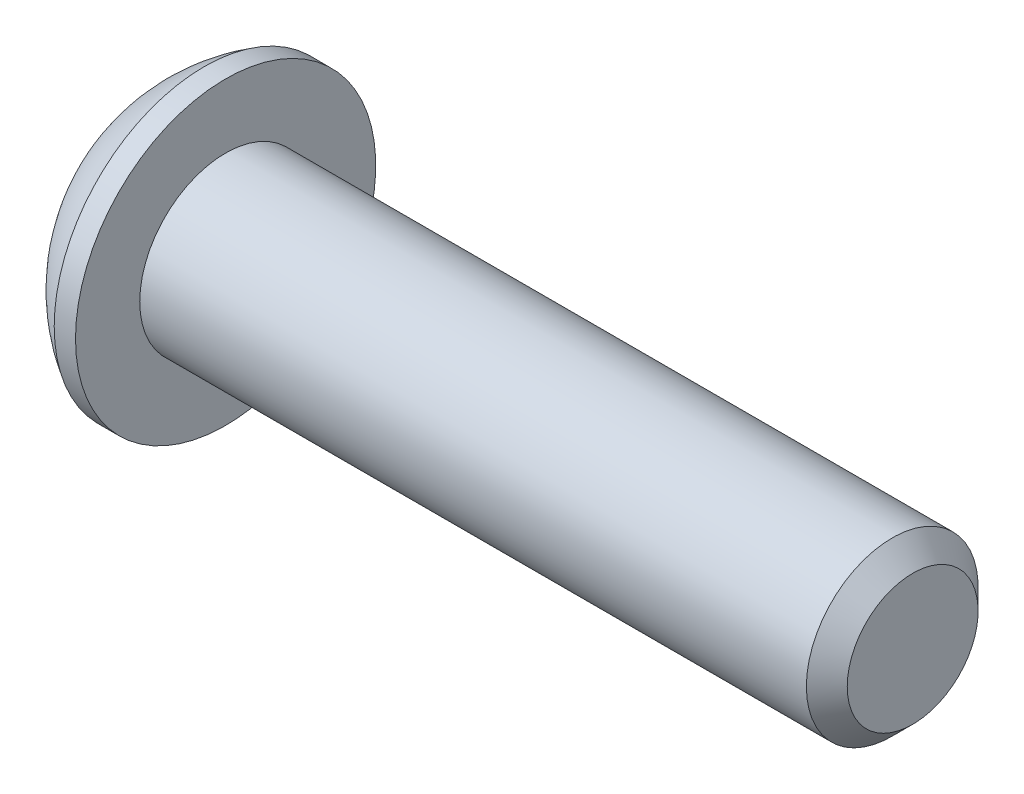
from build123d import *

# Parameters (mm, degrees)
HEX_2_DEPTH = 2.2098


with BuildPart() as part:
    # BodySke → BaseBody (revolve)
    with BuildSketch(Plane.XY, mode=Mode.PRIVATE) as basebody_sk:
        with BuildLine():
            Line((28.7528, 0), (28.7528, 2.41935))
            Line((28.7528, 2.41935), (27.99715, 3.175))
            Line((27.99715, 3.175), (3.3528, 3.175))
            Line((3.3528, 3.175), (3.3528, 5.5499))
            Line((3.3528, 5.5499), (2.5654, 5.5499))
            ThreePointArc((2.5654, 5.5499), (1.073764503, 4.355582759), (0, 2.77495))
            Line((0, 2.77495), (0, 0))
            Line((0, 0), (28.7528, 0))
        make_face()
    revolve(basebody_sk.sketch.rotate(Axis((0, 0, 0), (1, 0, 0)), 90), axis=Axis((0, 0, 0), (1, 0, 0)))

    # Sketch2 → PreBroach (revolve, cut)
    with BuildSketch(Plane.XY, mode=Mode.PRIVATE) as prebroach_sk:
        Polygon((0, 1.9812), (2.2098, 1.9812), (3.353646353, 0), (0, 0), align=None)
    revolve(prebroach_sk.sketch.rotate(Axis((0, 0, 0), (1, 0, 0)), 90), axis=Axis((0, 0, 0), (1, 0, 0)), mode=Mode.SUBTRACT)

    # Sketch3 → Hex 2 (cut)
    with BuildSketch(Plane(origin=(0, 0, 0), x_dir=(0, 0, -1), z_dir=(1, 0, 0))):
        Polygon((-1.9812, -1.143846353), (-1.9812, 1.143846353), (0, 2.287692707), (1.9812, 1.143846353), (1.9812, -1.143846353), (0, -2.287692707), align=None)
    extrude(amount=HEX_2_DEPTH, mode=Mode.SUBTRACT)


solid = part.part
